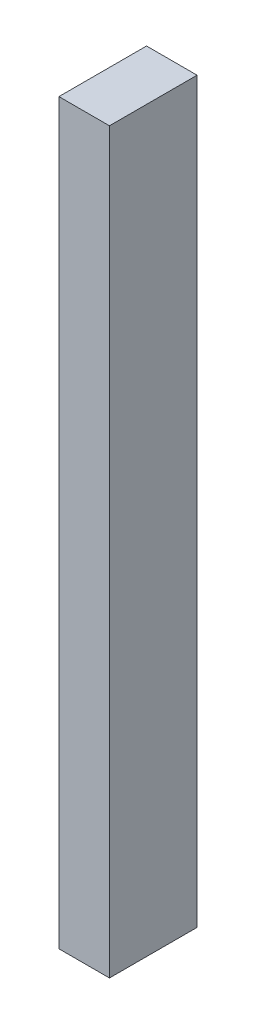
ISO-10303-21;
HEADER;
FILE_DESCRIPTION(('STEP AP214'),'2;1');
FILE_NAME('part.step','',(''),(''),'','','');
FILE_SCHEMA(('AUTOMOTIVE_DESIGN { 1 0 10303 214 1 1 1 1 }'));
ENDSEC;
DATA;
#1=APPLICATION_CONTEXT('core data for automotive mechanical design processes');
#2=APPLICATION_PROTOCOL_DEFINITION('international standard','automotive_design',2000,#1);
#3=PRODUCT_CONTEXT('',#1,'mechanical');
#4=PRODUCT('Part','Part','',(#3));
#5=PRODUCT_RELATED_PRODUCT_CATEGORY('part','',(#4));
#6=PRODUCT_DEFINITION_FORMATION('','',#4);
#7=PRODUCT_DEFINITION_CONTEXT('part definition',#1,'design');
#8=PRODUCT_DEFINITION('design','',#6,#7);
#9=PRODUCT_DEFINITION_SHAPE('','',#8);
#10=(LENGTH_UNIT() NAMED_UNIT(*) SI_UNIT(.MILLI.,.METRE.));
#11=(NAMED_UNIT(*) PLANE_ANGLE_UNIT() SI_UNIT($,.RADIAN.));
#12=(NAMED_UNIT(*) SI_UNIT($,.STERADIAN.) SOLID_ANGLE_UNIT());
#13=UNCERTAINTY_MEASURE_WITH_UNIT(LENGTH_MEASURE(1.E-05),#10,'distance_accuracy_value','');
#14=(GEOMETRIC_REPRESENTATION_CONTEXT(3) GLOBAL_UNCERTAINTY_ASSIGNED_CONTEXT((#13)) GLOBAL_UNIT_ASSIGNED_CONTEXT((#10,
#11,#12)) REPRESENTATION_CONTEXT('',''));
#15=CARTESIAN_POINT('',(0.,0.,0.));
#16=DIRECTION('',(0.,0.,1.));
#17=DIRECTION('',(1.,0.,0.));
#18=AXIS2_PLACEMENT_3D('',#15,#16,#17);
#19=CARTESIAN_POINT('',(1.5,21.9,5.2));
#20=DIRECTION('',(-1.,0.,0.));
#21=DIRECTION('',(0.,-1.,0.));
#22=AXIS2_PLACEMENT_3D('',#19,#20,#21);
#23=PLANE('',#22);
#24=DIRECTION('',(0.,1.,0.));
#25=VECTOR('',#24,1.);
#26=CARTESIAN_POINT('',(1.5,21.9,0.));
#27=LINE('',#26,#25);
#28=CARTESIAN_POINT('',(1.5,-21.9,0.));
#29=VERTEX_POINT('',#28);
#30=CARTESIAN_POINT('',(1.5,21.9,0.));
#31=VERTEX_POINT('',#30);
#32=EDGE_CURVE('E102',#29,#31,#27,.T.);
#33=ORIENTED_EDGE('',*,*,#32,.T.);
#34=DIRECTION('',(0.,0.,-1.));
#35=VECTOR('',#34,1.);
#36=CARTESIAN_POINT('',(1.5,21.9,5.2));
#37=LINE('',#36,#35);
#38=CARTESIAN_POINT('',(1.5,21.9,5.2));
#39=VERTEX_POINT('',#38);
#40=EDGE_CURVE('E11',#39,#31,#37,.T.);
#41=ORIENTED_EDGE('',*,*,#40,.F.);
#42=DIRECTION('',(0.,1.,0.));
#43=VECTOR('',#42,1.);
#44=CARTESIAN_POINT('',(1.5,21.9,5.2));
#45=LINE('',#44,#43);
#46=CARTESIAN_POINT('',(1.5,-21.9,5.2));
#47=VERTEX_POINT('',#46);
#48=EDGE_CURVE('E90',#47,#39,#45,.T.);
#49=ORIENTED_EDGE('',*,*,#48,.F.);
#50=DIRECTION('',(0.,0.,-1.));
#51=VECTOR('',#50,1.);
#52=CARTESIAN_POINT('',(1.5,-21.9,5.2));
#53=LINE('',#52,#51);
#54=EDGE_CURVE('E98',#47,#29,#53,.T.);
#55=ORIENTED_EDGE('',*,*,#54,.T.);
#56=EDGE_LOOP('',(#33,#41,#49,#55));
#57=FACE_BOUND('',#56,.T.);
#58=ADVANCED_FACE('F39',(#57),#23,.F.);
#59=CARTESIAN_POINT('',(-1.5,21.9,5.2));
#60=DIRECTION('',(0.,-1.,0.));
#61=DIRECTION('',(0.,0.,-1.));
#62=AXIS2_PLACEMENT_3D('',#59,#60,#61);
#63=PLANE('',#62);
#64=DIRECTION('',(-1.,0.,0.));
#65=VECTOR('',#64,1.);
#66=CARTESIAN_POINT('',(-1.5,21.9,0.));
#67=LINE('',#66,#65);
#68=CARTESIAN_POINT('',(-1.5,21.9,0.));
#69=VERTEX_POINT('',#68);
#70=EDGE_CURVE('E94',#31,#69,#67,.T.);
#71=ORIENTED_EDGE('',*,*,#70,.T.);
#72=DIRECTION('',(0.,0.,-1.));
#73=VECTOR('',#72,1.);
#74=CARTESIAN_POINT('',(-1.5,21.9,5.2));
#75=LINE('',#74,#73);
#76=CARTESIAN_POINT('',(-1.5,21.9,5.2));
#77=VERTEX_POINT('',#76);
#78=EDGE_CURVE('E47',#77,#69,#75,.T.);
#79=ORIENTED_EDGE('',*,*,#78,.F.);
#80=DIRECTION('',(-1.,0.,0.));
#81=VECTOR('',#80,1.);
#82=CARTESIAN_POINT('',(-1.5,21.9,5.2));
#83=LINE('',#82,#81);
#84=EDGE_CURVE('E85',#39,#77,#83,.T.);
#85=ORIENTED_EDGE('',*,*,#84,.F.);
#86=ORIENTED_EDGE('',*,*,#40,.T.);
#87=EDGE_LOOP('',(#71,#79,#85,#86));
#88=FACE_BOUND('',#87,.T.);
#89=ADVANCED_FACE('F93',(#88),#63,.F.);
#90=CARTESIAN_POINT('',(-1.5,21.9,5.2));
#91=DIRECTION('',(1.,0.,0.));
#92=DIRECTION('',(0.,1.,0.));
#93=AXIS2_PLACEMENT_3D('',#90,#91,#92);
#94=PLANE('',#93);
#95=DIRECTION('',(0.,-1.,0.));
#96=VECTOR('',#95,1.);
#97=CARTESIAN_POINT('',(-1.5,21.9,0.));
#98=LINE('',#97,#96);
#99=CARTESIAN_POINT('',(-1.5,-21.9,0.));
#100=VERTEX_POINT('',#99);
#101=EDGE_CURVE('E72',#69,#100,#98,.T.);
#102=ORIENTED_EDGE('',*,*,#101,.T.);
#103=DIRECTION('',(0.,0.,-1.));
#104=VECTOR('',#103,1.);
#105=CARTESIAN_POINT('',(-1.5,-21.9,5.2));
#106=LINE('',#105,#104);
#107=CARTESIAN_POINT('',(-1.5,-21.9,5.2));
#108=VERTEX_POINT('',#107);
#109=EDGE_CURVE('E95',#108,#100,#106,.T.);
#110=ORIENTED_EDGE('',*,*,#109,.F.);
#111=DIRECTION('',(0.,-1.,0.));
#112=VECTOR('',#111,1.);
#113=CARTESIAN_POINT('',(-1.5,21.9,5.2));
#114=LINE('',#113,#112);
#115=EDGE_CURVE('E88',#77,#108,#114,.T.);
#116=ORIENTED_EDGE('',*,*,#115,.F.);
#117=ORIENTED_EDGE('',*,*,#78,.T.);
#118=EDGE_LOOP('',(#102,#110,#116,#117));
#119=FACE_BOUND('',#118,.T.);
#120=ADVANCED_FACE('F96',(#119),#94,.F.);
#121=CARTESIAN_POINT('',(-1.5,-21.9,5.2));
#122=DIRECTION('',(0.,1.,0.));
#123=DIRECTION('',(0.,0.,1.));
#124=AXIS2_PLACEMENT_3D('',#121,#122,#123);
#125=PLANE('',#124);
#126=DIRECTION('',(1.,0.,0.));
#127=VECTOR('',#126,1.);
#128=CARTESIAN_POINT('',(-1.5,-21.9,0.));
#129=LINE('',#128,#127);
#130=EDGE_CURVE('E78',#100,#29,#129,.T.);
#131=ORIENTED_EDGE('',*,*,#130,.T.);
#132=ORIENTED_EDGE('',*,*,#54,.F.);
#133=DIRECTION('',(1.,0.,0.));
#134=VECTOR('',#133,1.);
#135=CARTESIAN_POINT('',(-1.5,-21.9,5.2));
#136=LINE('',#135,#134);
#137=EDGE_CURVE('E55',#108,#47,#136,.T.);
#138=ORIENTED_EDGE('',*,*,#137,.F.);
#139=ORIENTED_EDGE('',*,*,#109,.T.);
#140=EDGE_LOOP('',(#131,#132,#138,#139));
#141=FACE_BOUND('',#140,.T.);
#142=ADVANCED_FACE('F109',(#141),#125,.F.);
#143=CARTESIAN_POINT('',(0.,0.,5.2));
#144=DIRECTION('',(0.,0.,1.));
#145=DIRECTION('',(1.,0.,0.));
#146=AXIS2_PLACEMENT_3D('',#143,#144,#145);
#147=PLANE('',#146);
#148=ORIENTED_EDGE('',*,*,#48,.T.);
#149=ORIENTED_EDGE('',*,*,#84,.T.);
#150=ORIENTED_EDGE('',*,*,#115,.T.);
#151=ORIENTED_EDGE('',*,*,#137,.T.);
#152=EDGE_LOOP('',(#148,#149,#150,#151));
#153=FACE_BOUND('',#152,.T.);
#154=ADVANCED_FACE('F86',(#153),#147,.T.);
#155=CARTESIAN_POINT('',(0.,0.,0.));
#156=DIRECTION('',(0.,0.,1.));
#157=DIRECTION('',(1.,0.,0.));
#158=AXIS2_PLACEMENT_3D('',#155,#156,#157);
#159=PLANE('',#158);
#160=ORIENTED_EDGE('',*,*,#32,.F.);
#161=ORIENTED_EDGE('',*,*,#130,.F.);
#162=ORIENTED_EDGE('',*,*,#101,.F.);
#163=ORIENTED_EDGE('',*,*,#70,.F.);
#164=EDGE_LOOP('',(#160,#161,#162,#163));
#165=FACE_BOUND('',#164,.T.);
#166=ADVANCED_FACE('F112',(#165),#159,.F.);
#167=CLOSED_SHELL('',(#58,#89,#120,#142,#154,#166));
#168=MANIFOLD_SOLID_BREP('B2',#167);
#169=ADVANCED_BREP_SHAPE_REPRESENTATION('',(#18,#168),#14);
#170=SHAPE_DEFINITION_REPRESENTATION(#9,#169);
ENDSEC;
END-ISO-10303-21;
